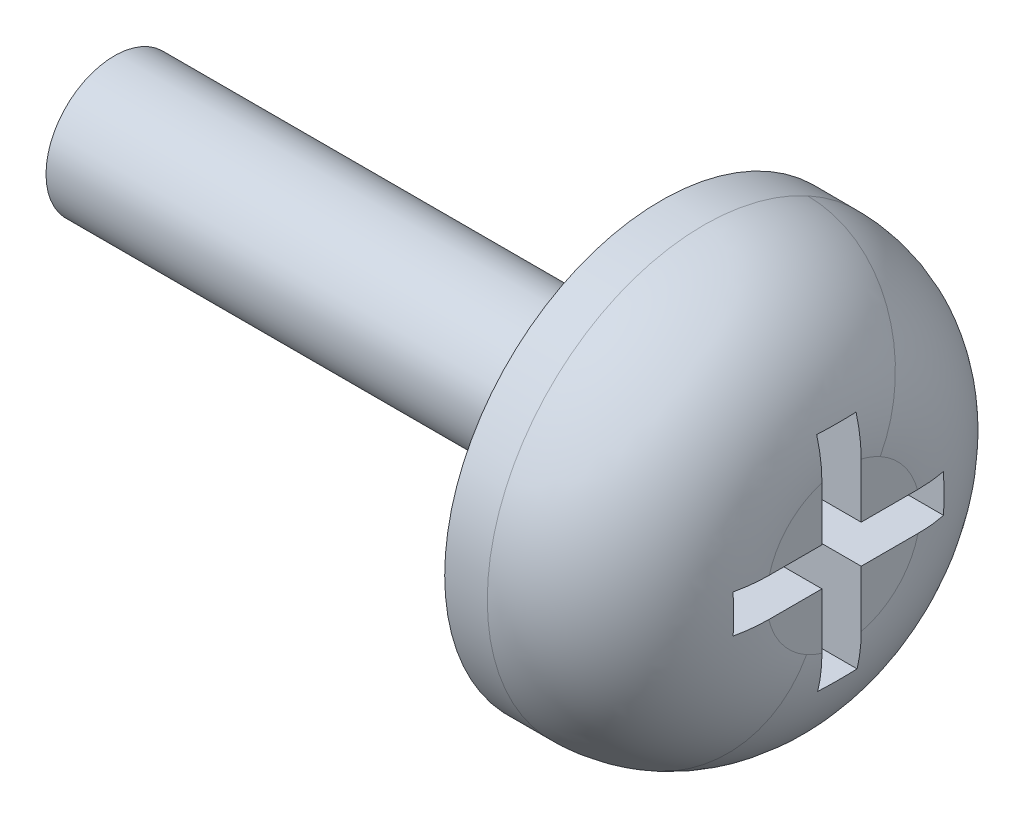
ISO-10303-21;
HEADER;
FILE_DESCRIPTION(('STEP AP214'),'2;1');
FILE_NAME('part.step','',(''),(''),'','','');
FILE_SCHEMA(('AUTOMOTIVE_DESIGN { 1 0 10303 214 1 1 1 1 }'));
ENDSEC;
DATA;
#1=APPLICATION_CONTEXT('core data for automotive mechanical design processes');
#2=APPLICATION_PROTOCOL_DEFINITION('international standard','automotive_design',2000,#1);
#3=PRODUCT_CONTEXT('',#1,'mechanical');
#4=PRODUCT('Part','Part','',(#3));
#5=PRODUCT_RELATED_PRODUCT_CATEGORY('part','',(#4));
#6=PRODUCT_DEFINITION_FORMATION('','',#4);
#7=PRODUCT_DEFINITION_CONTEXT('part definition',#1,'design');
#8=PRODUCT_DEFINITION('design','',#6,#7);
#9=PRODUCT_DEFINITION_SHAPE('','',#8);
#10=(LENGTH_UNIT() NAMED_UNIT(*) SI_UNIT(.MILLI.,.METRE.));
#11=(NAMED_UNIT(*) PLANE_ANGLE_UNIT() SI_UNIT($,.RADIAN.));
#12=(NAMED_UNIT(*) SI_UNIT($,.STERADIAN.) SOLID_ANGLE_UNIT());
#13=UNCERTAINTY_MEASURE_WITH_UNIT(LENGTH_MEASURE(1.E-05),#10,'distance_accuracy_value','');
#14=(GEOMETRIC_REPRESENTATION_CONTEXT(3) GLOBAL_UNCERTAINTY_ASSIGNED_CONTEXT((#13)) GLOBAL_UNIT_ASSIGNED_CONTEXT((#10,
#11,#12)) REPRESENTATION_CONTEXT('',''));
#15=CARTESIAN_POINT('',(0.,0.,0.));
#16=DIRECTION('',(0.,0.,1.));
#17=DIRECTION('',(1.,0.,0.));
#18=AXIS2_PLACEMENT_3D('',#15,#16,#17);
#19=CARTESIAN_POINT('',(0.,0.,2.340342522));
#20=DIRECTION('',(0.,0.,1.));
#21=DIRECTION('',(1.,0.,0.));
#22=AXIS2_PLACEMENT_3D('',#19,#20,#21);
#23=PLANE('',#22);
#24=DIRECTION('',(1.,0.,0.));
#25=VECTOR('',#24,1.);
#26=CARTESIAN_POINT('',(0.,-0.3962841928,2.340342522));
#27=LINE('',#26,#25);
#28=CARTESIAN_POINT('',(15.9216123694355,-0.396284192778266,2.340342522));
#29=VERTEX_POINT('',#28);
#30=CARTESIAN_POINT('',(14.,-0.3962841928,2.340342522));
#31=VERTEX_POINT('',#30);
#32=EDGE_CURVE('E161',#29,#31,#27,.F.);
#33=ORIENTED_EDGE('',*,*,#32,.T.);
#34=DIRECTION('',(0.,1.,0.));
#35=VECTOR('',#34,1.);
#36=CARTESIAN_POINT('',(14.,0.,2.340342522));
#37=LINE('',#36,#35);
#38=CARTESIAN_POINT('',(14.,0.4401714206,2.340342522));
#39=VERTEX_POINT('',#38);
#40=EDGE_CURVE('E170',#39,#31,#37,.F.);
#41=ORIENTED_EDGE('',*,*,#40,.F.);
#42=DIRECTION('',(-1.,0.,0.));
#43=VECTOR('',#42,1.);
#44=CARTESIAN_POINT('',(0.,0.4401714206,2.340342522));
#45=LINE('',#44,#43);
#46=CARTESIAN_POINT('',(15.9198215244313,0.44017142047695,2.34034252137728));
#47=VERTEX_POINT('',#46);
#48=EDGE_CURVE('E164',#39,#47,#45,.F.);
#49=ORIENTED_EDGE('',*,*,#48,.T.);
#50=CARTESIAN_POINT('',(15.921612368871,-0.396284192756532,2.340342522));
#51=CARTESIAN_POINT('',(15.9233983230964,-0.349822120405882,2.340342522));
#52=CARTESIAN_POINT('',(15.924852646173,-0.303347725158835,2.340342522));
#53=CARTESIAN_POINT('',(15.9271239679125,-0.210399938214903,2.340342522));
#54=CARTESIAN_POINT('',(15.9279411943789,-0.163926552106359,2.340342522));
#55=CARTESIAN_POINT('',(15.9289654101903,-0.0709814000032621,2.340342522));
#56=CARTESIAN_POINT('',(15.9291725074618,-0.0245096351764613,2.340342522));
#57=CARTESIAN_POINT('',(15.9289815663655,0.0684327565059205,2.340342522));
#58=CARTESIAN_POINT('',(15.9285835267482,0.114903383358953,2.340342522));
#59=CARTESIAN_POINT('',(15.9271719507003,0.207843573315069,2.340342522));
#60=CARTESIAN_POINT('',(15.926158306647,0.254313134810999,2.340342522));
#61=CARTESIAN_POINT('',(15.9234835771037,0.347250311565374,2.340342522));
#62=CARTESIAN_POINT('',(15.9218222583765,0.393717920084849,2.340342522));
#63=CARTESIAN_POINT('',(15.9198215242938,0.44017142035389,2.340342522));
#64=B_SPLINE_CURVE_WITH_KNOTS('',3,(#50,#51,#52,#53,#54,#55,#56,#57,#58,#59,#60,#61,#62,#63),
.UNSPECIFIED.,.F.,.F.,(4,2,2,2,2,2,4),(0.,0.139487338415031,0.278924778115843,0.418337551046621,
0.557750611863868,0.697188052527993,0.83667575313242),.UNSPECIFIED.);
#65=EDGE_CURVE('E36',#29,#47,#64,.T.);
#66=ORIENTED_EDGE('',*,*,#65,.F.);
#67=EDGE_LOOP('',(#33,#41,#49,#66));
#68=FACE_BOUND('',#67,.T.);
#69=ADVANCED_FACE('F32',(#68),#23,.F.);
#70=CARTESIAN_POINT('',(0.,-2.392984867,0.));
#71=DIRECTION('',(0.,-1.,0.));
#72=DIRECTION('',(1.,0.,0.));
#73=AXIS2_PLACEMENT_3D('',#70,#71,#72);
#74=PLANE('',#73);
#75=DIRECTION('',(-1.,0.,0.));
#76=VECTOR('',#75,1.);
#77=CARTESIAN_POINT('',(0.,-2.392984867,-0.3906822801));
#78=LINE('',#77,#76);
#79=CARTESIAN_POINT('',(15.9093883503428,-2.392984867,-0.390682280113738));
#80=VERTEX_POINT('',#79);
#81=CARTESIAN_POINT('',(14.,-2.392984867,-0.3906822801));
#82=VERTEX_POINT('',#81);
#83=EDGE_CURVE('E461',#80,#82,#78,.T.);
#84=ORIENTED_EDGE('',*,*,#83,.T.);
#85=DIRECTION('',(0.,0.,1.));
#86=VECTOR('',#85,1.);
#87=CARTESIAN_POINT('',(14.,-2.392984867,0.));
#88=LINE('',#87,#86);
#89=CARTESIAN_POINT('',(14.,-2.392984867,0.4703304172));
#90=VERTEX_POINT('',#89);
#91=EDGE_CURVE('E169',#90,#82,#88,.F.);
#92=ORIENTED_EDGE('',*,*,#91,.F.);
#93=DIRECTION('',(1.,0.,0.));
#94=VECTOR('',#93,1.);
#95=CARTESIAN_POINT('',(0.,-2.392984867,0.4703304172));
#96=LINE('',#95,#94);
#97=CARTESIAN_POINT('',(15.9058459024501,-2.39298486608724,0.470330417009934));
#98=VERTEX_POINT('',#97);
#99=EDGE_CURVE('E478',#90,#98,#96,.T.);
#100=ORIENTED_EDGE('',*,*,#99,.T.);
#101=CARTESIAN_POINT('',(15.9093883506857,-2.392984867,-0.390682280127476));
#102=CARTESIAN_POINT('',(15.911301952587,-2.392984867,-0.34285368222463));
#103=CARTESIAN_POINT('',(15.9128474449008,-2.392984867,-0.295010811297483));
#104=CARTESIAN_POINT('',(15.9152275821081,-2.392984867,-0.199327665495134));
#105=CARTESIAN_POINT('',(15.9160625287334,-2.392984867,-0.151487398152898));
#106=CARTESIAN_POINT('',(15.9170484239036,-2.392984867,-0.0558100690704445));
#107=CARTESIAN_POINT('',(15.917199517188,-2.392984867,-0.00797300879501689));
#108=CARTESIAN_POINT('',(15.9168209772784,-2.392984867,0.0876986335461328));
#109=CARTESIAN_POINT('',(15.9162913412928,-2.392984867,0.135533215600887));
#110=CARTESIAN_POINT('',(15.9145381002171,-2.392984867,0.231199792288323));
#111=CARTESIAN_POINT('',(15.9133143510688,-2.392984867,0.279031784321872));
#112=CARTESIAN_POINT('',(15.9101368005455,-2.392984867,0.374692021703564));
#113=CARTESIAN_POINT('',(15.9081826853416,-2.392984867,0.422520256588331));
#114=CARTESIAN_POINT('',(15.9058459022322,-2.392984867,0.470330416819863));
#115=B_SPLINE_CURVE_WITH_KNOTS('',3,(#101,#102,#103,#104,#105,#106,#107,#108,#109,#110,#111,
#112,#113,#114),.UNSPECIFIED.,.F.,.F.,(4,2,2,2,2,2,4),(0.,0.143598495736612,0.287135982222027,
0.430643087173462,0.574150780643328,0.717688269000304,0.861287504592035),.UNSPECIFIED.);
#116=EDGE_CURVE('E178',#80,#98,#115,.T.);
#117=ORIENTED_EDGE('',*,*,#116,.F.);
#118=EDGE_LOOP('',(#84,#92,#100,#117));
#119=FACE_BOUND('',#118,.T.);
#120=ADVANCED_FACE('F213',(#119),#74,.F.);
#121=CARTESIAN_POINT('',(0.,-0.3962841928,0.));
#122=DIRECTION('',(0.,-1.,0.));
#123=DIRECTION('',(1.,0.,0.));
#124=AXIS2_PLACEMENT_3D('',#121,#122,#123);
#125=PLANE('',#124);
#126=DIRECTION('',(0.,0.,1.));
#127=VECTOR('',#126,1.);
#128=CARTESIAN_POINT('',(16.,-0.3962841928,0.));
#129=LINE('',#128,#127);
#130=CARTESIAN_POINT('',(16.,-0.3962841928,0.4703304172));
#131=VERTEX_POINT('',#130);
#132=CARTESIAN_POINT('',(15.9999999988,-0.396284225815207,1.63763286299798));
#133=VERTEX_POINT('',#132);
#134=EDGE_CURVE('E177',#131,#133,#129,.T.);
#135=ORIENTED_EDGE('',*,*,#134,.F.);
#136=DIRECTION('',(1.,0.,0.));
#137=VECTOR('',#136,1.);
#138=CARTESIAN_POINT('',(0.,-0.3962841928,0.4703304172));
#139=LINE('',#138,#137);
#140=CARTESIAN_POINT('',(14.,-0.3962841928,0.4703304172));
#141=VERTEX_POINT('',#140);
#142=EDGE_CURVE('E481',#131,#141,#139,.F.);
#143=ORIENTED_EDGE('',*,*,#142,.T.);
#144=DIRECTION('',(0.,0.,1.));
#145=VECTOR('',#144,1.);
#146=CARTESIAN_POINT('',(14.,-0.3962841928,0.));
#147=LINE('',#146,#145);
#148=EDGE_CURVE('E176',#141,#31,#147,.T.);
#149=ORIENTED_EDGE('',*,*,#148,.T.);
#150=ORIENTED_EDGE('',*,*,#32,.F.);
#151=CARTESIAN_POINT('',(15.999999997,-0.3962841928,1.63763286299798));
#152=CARTESIAN_POINT('',(16.0000009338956,-0.3962841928,1.6770867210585));
#153=CARTESIAN_POINT('',(15.9992803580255,-0.3962841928,1.71654107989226));
#154=CARTESIAN_POINT('',(15.9963900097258,-0.3962841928,1.79528766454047));
#155=CARTESIAN_POINT('',(15.9942242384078,-0.3962841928,1.83458003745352));
#156=CARTESIAN_POINT('',(15.9884414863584,-0.3962841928,1.91300271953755));
#157=CARTESIAN_POINT('',(15.9848265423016,-0.3962841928,1.952133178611));
#158=CARTESIAN_POINT('',(15.9761411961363,-0.3962841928,2.03023320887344));
#159=CARTESIAN_POINT('',(15.9710707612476,-0.3962841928,2.0692027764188));
#160=CARTESIAN_POINT('',(15.9594656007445,-0.3962841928,2.14697836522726));
#161=CARTESIAN_POINT('',(15.9529288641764,-0.396284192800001,2.18578408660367));
#162=CARTESIAN_POINT('',(15.9383784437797,-0.396284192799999,2.26322982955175));
#163=CARTESIAN_POINT('',(15.930360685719,-0.396284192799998,2.30186908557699));
#164=CARTESIAN_POINT('',(15.9216123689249,-0.396284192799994,2.34034252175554));
#165=B_SPLINE_CURVE_WITH_KNOTS('',3,(#151,#152,#153,#154,#155,#156,#157,#158,#159,#160,#161,
#162,#163,#164),.UNSPECIFIED.,.F.,.F.,(4,2,2,2,2,2,4),(0.,0.118355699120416,0.236385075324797,
0.354249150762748,0.472115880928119,0.590145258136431,0.708504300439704),.UNSPECIFIED.);
#166=EDGE_CURVE('E173',#133,#29,#165,.T.);
#167=ORIENTED_EDGE('',*,*,#166,.F.);
#168=EDGE_LOOP('',(#135,#143,#149,#150,#167));
#169=FACE_BOUND('',#168,.T.);
#170=ADVANCED_FACE('F172',(#169),#125,.F.);
#171=CARTESIAN_POINT('',(0.,0.4401714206,0.));
#172=DIRECTION('',(0.,1.,0.));
#173=DIRECTION('',(-1.,0.,0.));
#174=AXIS2_PLACEMENT_3D('',#171,#172,#173);
#175=PLANE('',#174);
#176=ORIENTED_EDGE('',*,*,#48,.F.);
#177=DIRECTION('',(0.,0.,1.));
#178=VECTOR('',#177,1.);
#179=CARTESIAN_POINT('',(14.,0.4401714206,0.));
#180=LINE('',#179,#178);
#181=CARTESIAN_POINT('',(14.,0.4401714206,0.4703304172));
#182=VERTEX_POINT('',#181);
#183=EDGE_CURVE('E492',#39,#182,#180,.F.);
#184=ORIENTED_EDGE('',*,*,#183,.T.);
#185=DIRECTION('',(1.,0.,0.));
#186=VECTOR('',#185,1.);
#187=CARTESIAN_POINT('',(0.,0.4401714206,0.4703304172));
#188=LINE('',#187,#186);
#189=CARTESIAN_POINT('',(16.,0.4401714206,0.4703304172));
#190=VERTEX_POINT('',#189);
#191=EDGE_CURVE('E497',#182,#190,#188,.T.);
#192=ORIENTED_EDGE('',*,*,#191,.T.);
#193=DIRECTION('',(0.,0.,1.));
#194=VECTOR('',#193,1.);
#195=CARTESIAN_POINT('',(16.,0.4401714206,0.));
#196=LINE('',#195,#194);
#197=CARTESIAN_POINT('',(15.9999999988,0.440171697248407,1.62638597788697));
#198=VERTEX_POINT('',#197);
#199=EDGE_CURVE('E186',#198,#190,#196,.F.);
#200=ORIENTED_EDGE('',*,*,#199,.F.);
#201=CARTESIAN_POINT('',(15.9198215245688,0.440171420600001,2.34034252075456));
#202=CARTESIAN_POINT('',(15.9287834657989,0.4401714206,2.30126342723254));
#203=CARTESIAN_POINT('',(15.9369942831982,0.4401714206,2.26201245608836));
#204=CARTESIAN_POINT('',(15.9518900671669,0.4401714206,2.18333730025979));
#205=CARTESIAN_POINT('',(15.958579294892,0.4401714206,2.14391392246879));
#206=CARTESIAN_POINT('',(15.9704508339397,0.4401714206,2.06489747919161));
#207=CARTESIAN_POINT('',(15.9756352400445,0.4401714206,2.02530472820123));
#208=CARTESIAN_POINT('',(15.9845122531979,0.4401714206,1.94595359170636));
#209=CARTESIAN_POINT('',(15.9882049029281,0.4401714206,1.90619521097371));
#210=CARTESIAN_POINT('',(15.9941094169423,0.4401714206,1.82651175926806));
#211=CARTESIAN_POINT('',(15.9963191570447,0.440171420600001,1.78658653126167));
#212=CARTESIAN_POINT('',(15.999267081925,0.440171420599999,1.70656941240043));
#213=CARTESIAN_POINT('',(16.0000011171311,0.440171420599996,1.6664773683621));
#214=CARTESIAN_POINT('',(15.999999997,0.440171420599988,1.62638597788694));
#215=B_SPLINE_CURVE_WITH_KNOTS('',3,(#201,#202,#203,#204,#205,#206,#207,#208,#209,#210,#211,
#212,#213,#214),.UNSPECIFIED.,.F.,.F.,(4,2,2,2,2,2,4),(0.,0.120272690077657,0.240204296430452,
0.359968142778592,0.47972856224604,0.599660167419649,0.719928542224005),.UNSPECIFIED.);
#216=EDGE_CURVE('E502',#47,#198,#215,.T.);
#217=ORIENTED_EDGE('',*,*,#216,.F.);
#218=EDGE_LOOP('',(#176,#184,#192,#200,#217));
#219=FACE_BOUND('',#218,.T.);
#220=ADVANCED_FACE('F212',(#219),#175,.F.);
#221=CARTESIAN_POINT('',(0.,0.,0.4703304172));
#222=DIRECTION('',(0.,0.,1.));
#223=DIRECTION('',(1.,0.,0.));
#224=AXIS2_PLACEMENT_3D('',#221,#222,#223);
#225=PLANE('',#224);
#226=DIRECTION('',(0.,1.,0.));
#227=VECTOR('',#226,1.);
#228=CARTESIAN_POINT('',(16.,0.,0.4703304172));
#229=LINE('',#228,#227);
#230=CARTESIAN_POINT('',(15.9999999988,1.61792209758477,0.470330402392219));
#231=VERTEX_POINT('',#230);
#232=EDGE_CURVE('E495',#190,#231,#229,.T.);
#233=ORIENTED_EDGE('',*,*,#232,.F.);
#234=ORIENTED_EDGE('',*,*,#191,.F.);
#235=DIRECTION('',(0.,1.,0.));
#236=VECTOR('',#235,1.);
#237=CARTESIAN_POINT('',(14.,0.,0.4703304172));
#238=LINE('',#237,#236);
#239=CARTESIAN_POINT('',(14.,2.477345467,0.4703304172));
#240=VERTEX_POINT('',#239);
#241=EDGE_CURVE('E475',#182,#240,#238,.T.);
#242=ORIENTED_EDGE('',*,*,#241,.T.);
#243=DIRECTION('',(-1.,0.,0.));
#244=VECTOR('',#243,1.);
#245=CARTESIAN_POINT('',(0.,2.477345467,0.4703304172));
#246=LINE('',#245,#244);
#247=CARTESIAN_POINT('',(15.883590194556,2.4773454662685,0.47033041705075));
#248=VERTEX_POINT('',#247);
#249=EDGE_CURVE('E468',#240,#248,#246,.F.);
#250=ORIENTED_EDGE('',*,*,#249,.T.);
#251=CARTESIAN_POINT('',(15.999999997,1.61792209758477,0.4703304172));
#252=CARTESIAN_POINT('',(16.000000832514,1.65431502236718,0.4703304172));
#253=CARTESIAN_POINT('',(15.999402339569,1.69070846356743,0.4703304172));
#254=CARTESIAN_POINT('',(15.9969982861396,1.76333096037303,0.4703304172));
#255=CARTESIAN_POINT('',(15.9951968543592,1.7995601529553,0.4703304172));
#256=CARTESIAN_POINT('',(15.9903842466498,1.87185413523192,0.4703304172));
#257=CARTESIAN_POINT('',(15.9873758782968,1.90791911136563,0.4703304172));
#258=CARTESIAN_POINT('',(15.9801465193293,1.97988429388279,0.4703304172));
#259=CARTESIAN_POINT('',(15.9759269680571,2.01578464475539,0.4703304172));
#260=CARTESIAN_POINT('',(15.966269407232,2.08742339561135,0.4703304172));
#261=CARTESIAN_POINT('',(15.9608313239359,2.12316178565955,0.4703304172));
#262=CARTESIAN_POINT('',(15.948728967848,2.19447221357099,0.4703304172));
#263=CARTESIAN_POINT('',(15.9420633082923,2.23004401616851,0.4703304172));
#264=CARTESIAN_POINT('',(15.9274946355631,2.30101904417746,0.4703304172));
#265=CARTESIAN_POINT('',(15.9195888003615,2.33642169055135,0.4703304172));
#266=CARTESIAN_POINT('',(15.9025257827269,2.40705559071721,0.4703304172));
#267=CARTESIAN_POINT('',(15.8933643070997,2.44228580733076,0.4703304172));
#268=CARTESIAN_POINT('',(15.883590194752,2.47734546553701,0.4703304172));
#269=B_SPLINE_CURVE_WITH_KNOTS('',3,(#251,#252,#253,#254,#255,#256,#257,#258,#259,#260,#261,
#262,#263,#264,#265,#266,#267,#268),.UNSPECIFIED.,.F.,.F.,(4,2,2,2,2,2,2,2,4),(0.,
0.109174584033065,0.217976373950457,0.326526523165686,0.434948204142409,0.543376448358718,
0.651927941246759,0.76073012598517,0.869914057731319),.UNSPECIFIED.);
#270=EDGE_CURVE('E487',#231,#248,#269,.T.);
#271=ORIENTED_EDGE('',*,*,#270,.F.);
#272=EDGE_LOOP('',(#233,#234,#242,#250,#271));
#273=FACE_BOUND('',#272,.T.);
#274=ADVANCED_FACE('F594',(#273),#225,.F.);
#275=CARTESIAN_POINT('',(0.,0.,0.4703304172));
#276=DIRECTION('',(0.,0.,1.));
#277=DIRECTION('',(1.,0.,0.));
#278=AXIS2_PLACEMENT_3D('',#275,#276,#277);
#279=PLANE('',#278);
#280=ORIENTED_EDGE('',*,*,#99,.F.);
#281=DIRECTION('',(0.,1.,0.));
#282=VECTOR('',#281,1.);
#283=CARTESIAN_POINT('',(14.,0.,0.4703304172));
#284=LINE('',#283,#282);
#285=EDGE_CURVE('E437',#90,#141,#284,.T.);
#286=ORIENTED_EDGE('',*,*,#285,.T.);
#287=ORIENTED_EDGE('',*,*,#142,.F.);
#288=DIRECTION('',(0.,1.,0.));
#289=VECTOR('',#288,1.);
#290=CARTESIAN_POINT('',(16.,0.,0.4703304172));
#291=LINE('',#290,#289);
#292=CARTESIAN_POINT('',(15.9999999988,-1.61792206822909,0.470330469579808));
#293=VERTEX_POINT('',#292);
#294=EDGE_CURVE('E484',#293,#131,#291,.T.);
#295=ORIENTED_EDGE('',*,*,#294,.F.);
#296=CARTESIAN_POINT('',(15.9058459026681,-2.39298486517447,0.4703304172));
#297=CARTESIAN_POINT('',(15.9163821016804,-2.35067174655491,0.4703304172));
#298=CARTESIAN_POINT('',(15.9260343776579,-2.30813908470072,0.4703304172));
#299=CARTESIAN_POINT('',(15.9435382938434,-2.22285223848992,0.4703304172));
#300=CARTESIAN_POINT('',(15.9513958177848,-2.18009926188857,0.4703304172));
#301=CARTESIAN_POINT('',(15.9653361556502,-2.09437701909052,0.4703304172));
#302=CARTESIAN_POINT('',(15.9714218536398,-2.051408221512,0.4703304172));
#303=CARTESIAN_POINT('',(15.9818392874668,-1.96526041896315,0.4703304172));
#304=CARTESIAN_POINT('',(15.9861710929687,-1.92208142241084,0.470330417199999));
#305=CARTESIAN_POINT('',(15.9930961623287,-1.83551165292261,0.470330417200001));
#306=CARTESIAN_POINT('',(15.9956864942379,-1.79212064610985,0.470330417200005));
#307=CARTESIAN_POINT('',(15.9991420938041,-1.70512692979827,0.470330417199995));
#308=CARTESIAN_POINT('',(16.0000016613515,-1.66152399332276,0.470330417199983));
#309=CARTESIAN_POINT('',(15.999999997,-1.61792206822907,0.470330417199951));
#310=B_SPLINE_CURVE_WITH_KNOTS('',3,(#296,#297,#298,#299,#300,#301,#302,#303,#304,#305,#306,
#307,#308,#309),.UNSPECIFIED.,.F.,.F.,(4,2,2,2,2,2,4),(0.,0.130805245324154,0.261175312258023,
0.391331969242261,0.521483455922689,0.651853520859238,0.782652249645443),.UNSPECIFIED.);
#311=EDGE_CURVE('E471',#98,#293,#310,.T.);
#312=ORIENTED_EDGE('',*,*,#311,.F.);
#313=EDGE_LOOP('',(#280,#286,#287,#295,#312));
#314=FACE_BOUND('',#313,.T.);
#315=ADVANCED_FACE('F590',(#314),#279,.F.);
#316=CARTESIAN_POINT('',(0.,2.477345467,0.));
#317=DIRECTION('',(0.,1.,0.));
#318=DIRECTION('',(-1.,0.,0.));
#319=AXIS2_PLACEMENT_3D('',#316,#317,#318);
#320=PLANE('',#319);
#321=ORIENTED_EDGE('',*,*,#249,.F.);
#322=DIRECTION('',(0.,0.,1.));
#323=VECTOR('',#322,1.);
#324=CARTESIAN_POINT('',(14.,2.477345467,0.));
#325=LINE('',#324,#323);
#326=CARTESIAN_POINT('',(14.,2.477345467,-0.3906822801));
#327=VERTEX_POINT('',#326);
#328=EDGE_CURVE('E447',#240,#327,#325,.F.);
#329=ORIENTED_EDGE('',*,*,#328,.T.);
#330=DIRECTION('',(-1.,0.,0.));
#331=VECTOR('',#330,1.);
#332=CARTESIAN_POINT('',(0.,2.477345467,-0.3906822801));
#333=LINE('',#332,#331);
#334=CARTESIAN_POINT('',(15.8874251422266,2.47734546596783,-0.390682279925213));
#335=VERTEX_POINT('',#334);
#336=EDGE_CURVE('E429',#327,#335,#333,.F.);
#337=ORIENTED_EDGE('',*,*,#336,.T.);
#338=CARTESIAN_POINT('',(15.88359019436,2.477345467,0.470330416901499));
#339=CARTESIAN_POINT('',(15.8861176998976,2.477345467,0.422524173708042));
#340=CARTESIAN_POINT('',(15.888235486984,2.477345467,0.374696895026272));
#341=CARTESIAN_POINT('',(15.8916832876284,2.477345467,0.27903805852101));
#342=CARTESIAN_POINT('',(15.8930136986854,2.477345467,0.231206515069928));
#343=CARTESIAN_POINT('',(15.8949206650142,2.477345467,0.135540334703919));
#344=CARTESIAN_POINT('',(15.8954974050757,2.477345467,0.0877057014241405));
#345=CARTESIAN_POINT('',(15.8959096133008,2.477345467,-0.00796654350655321));
#346=CARTESIAN_POINT('',(15.895745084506,2.477345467,-0.055804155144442));
#347=CARTESIAN_POINT('',(15.8946719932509,2.477345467,-0.15148309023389));
#348=CARTESIAN_POINT('',(15.8937632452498,2.477345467,-0.199324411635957));
#349=CARTESIAN_POINT('',(15.8911770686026,2.477345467,-0.29501016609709));
#350=CARTESIAN_POINT('',(15.8894992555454,2.477345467,-0.342854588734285));
#351=CARTESIAN_POINT('',(15.88742514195,2.477345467,-0.390682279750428));
#352=B_SPLINE_CURVE_WITH_KNOTS('',3,(#338,#339,#340,#341,#342,#343,#344,#345,#346,#347,#348,
#349,#350,#351),.UNSPECIFIED.,.F.,.F.,(4,2,2,2,2,2,4),(0.,0.143616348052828,0.287160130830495,
0.430668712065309,0.574176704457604,0.717720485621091,0.861336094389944),.UNSPECIFIED.);
#353=EDGE_CURVE('E465',#248,#335,#352,.T.);
#354=ORIENTED_EDGE('',*,*,#353,.F.);
#355=EDGE_LOOP('',(#321,#329,#337,#354));
#356=FACE_BOUND('',#355,.T.);
#357=ADVANCED_FACE('F585',(#356),#320,.F.);
#358=CARTESIAN_POINT('',(0.,0.,-0.3906822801));
#359=DIRECTION('',(0.,0.,-1.));
#360=DIRECTION('',(-1.,0.,0.));
#361=AXIS2_PLACEMENT_3D('',#358,#359,#360);
#362=PLANE('',#361);
#363=DIRECTION('',(0.,1.,0.));
#364=VECTOR('',#363,1.);
#365=CARTESIAN_POINT('',(16.,0.,-0.3906822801));
#366=LINE('',#365,#364);
#367=CARTESIAN_POINT('',(16.,-0.3962841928,-0.3906822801));
#368=VERTEX_POINT('',#367);
#369=CARTESIAN_POINT('',(15.9999999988,-1.63897833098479,-0.390682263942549));
#370=VERTEX_POINT('',#369);
#371=EDGE_CURVE('E458',#368,#370,#366,.F.);
#372=ORIENTED_EDGE('',*,*,#371,.F.);
#373=DIRECTION('',(1.,0.,0.));
#374=VECTOR('',#373,1.);
#375=CARTESIAN_POINT('',(0.,-0.3962841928,-0.3906822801));
#376=LINE('',#375,#374);
#377=CARTESIAN_POINT('',(14.,-0.3962841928,-0.3906822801));
#378=VERTEX_POINT('',#377);
#379=EDGE_CURVE('E405',#368,#378,#376,.F.);
#380=ORIENTED_EDGE('',*,*,#379,.T.);
#381=DIRECTION('',(0.,1.,0.));
#382=VECTOR('',#381,1.);
#383=CARTESIAN_POINT('',(14.,0.,-0.3906822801));
#384=LINE('',#383,#382);
#385=EDGE_CURVE('E446',#378,#82,#384,.F.);
#386=ORIENTED_EDGE('',*,*,#385,.T.);
#387=ORIENTED_EDGE('',*,*,#83,.F.);
#388=CARTESIAN_POINT('',(15.999999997,-1.63897833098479,-0.390682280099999));
#389=CARTESIAN_POINT('',(16.0000012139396,-1.6813835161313,-0.3906822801));
#390=CARTESIAN_POINT('',(15.9991672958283,-1.7237893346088,-0.3906822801));
#391=CARTESIAN_POINT('',(15.9958229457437,-1.80839903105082,-0.3906822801));
#392=CARTESIAN_POINT('',(15.9933178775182,-1.85060312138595,-0.3906822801));
#393=CARTESIAN_POINT('',(15.9866305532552,-1.9348095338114,-0.3906822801));
#394=CARTESIAN_POINT('',(15.9824510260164,-1.97681207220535,-0.3906822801));
#395=CARTESIAN_POINT('',(15.9724108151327,-2.06061694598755,-0.3906822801));
#396=CARTESIAN_POINT('',(15.9665500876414,-2.10241927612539,-0.3906822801));
#397=CARTESIAN_POINT('',(15.9531371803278,-2.18582044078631,-0.3906822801));
#398=CARTESIAN_POINT('',(15.9455823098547,-2.22741884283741,-0.390682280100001));
#399=CARTESIAN_POINT('',(15.9287654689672,-2.31040931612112,-0.390682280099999));
#400=CARTESIAN_POINT('',(15.9194980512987,-2.35180028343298,-0.390682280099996));
#401=CARTESIAN_POINT('',(15.9093883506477,-2.39298486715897,-0.390682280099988));
#402=B_SPLINE_CURVE_WITH_KNOTS('',3,(#388,#389,#390,#391,#392,#393,#394,#395,#396,#397,#398,
#399,#400,#401),.UNSPECIFIED.,.F.,.F.,(4,2,2,2,2,2,4),(0.,0.12720824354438,0.25401014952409,
0.380606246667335,0.507205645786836,0.634007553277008,0.76121995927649),.UNSPECIFIED.);
#403=EDGE_CURVE('E460',#370,#80,#402,.T.);
#404=ORIENTED_EDGE('',*,*,#403,.F.);
#405=EDGE_LOOP('',(#372,#380,#386,#387,#404));
#406=FACE_BOUND('',#405,.T.);
#407=ADVANCED_FACE('F582',(#406),#362,.F.);
#408=CARTESIAN_POINT('',(14.,0.,0.));
#409=DIRECTION('',(-1.,0.,0.));
#410=DIRECTION('',(0.,0.,1.));
#411=AXIS2_PLACEMENT_3D('',#408,#409,#410);
#412=PLANE('',#411);
#413=ORIENTED_EDGE('',*,*,#91,.T.);
#414=ORIENTED_EDGE('',*,*,#385,.F.);
#415=DIRECTION('',(0.,0.,1.));
#416=VECTOR('',#415,1.);
#417=CARTESIAN_POINT('',(14.,-0.3962841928,0.));
#418=LINE('',#417,#416);
#419=CARTESIAN_POINT('',(14.,-0.3962841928,-2.260694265));
#420=VERTEX_POINT('',#419);
#421=EDGE_CURVE('E409',#378,#420,#418,.F.);
#422=ORIENTED_EDGE('',*,*,#421,.T.);
#423=DIRECTION('',(0.,1.,0.));
#424=VECTOR('',#423,1.);
#425=CARTESIAN_POINT('',(14.,0.,-2.260694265));
#426=LINE('',#425,#424);
#427=CARTESIAN_POINT('',(14.,0.4401714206,-2.260694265));
#428=VERTEX_POINT('',#427);
#429=EDGE_CURVE('E444',#428,#420,#426,.F.);
#430=ORIENTED_EDGE('',*,*,#429,.F.);
#431=DIRECTION('',(0.,0.,1.));
#432=VECTOR('',#431,1.);
#433=CARTESIAN_POINT('',(14.,0.4401714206,0.));
#434=LINE('',#433,#432);
#435=CARTESIAN_POINT('',(14.,0.4401714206,-0.3906822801));
#436=VERTEX_POINT('',#435);
#437=EDGE_CURVE('E397',#428,#436,#434,.T.);
#438=ORIENTED_EDGE('',*,*,#437,.T.);
#439=DIRECTION('',(0.,1.,0.));
#440=VECTOR('',#439,1.);
#441=CARTESIAN_POINT('',(14.,0.,-0.3906822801));
#442=LINE('',#441,#440);
#443=EDGE_CURVE('E432',#436,#327,#442,.T.);
#444=ORIENTED_EDGE('',*,*,#443,.T.);
#445=ORIENTED_EDGE('',*,*,#328,.F.);
#446=ORIENTED_EDGE('',*,*,#241,.F.);
#447=ORIENTED_EDGE('',*,*,#183,.F.);
#448=ORIENTED_EDGE('',*,*,#40,.T.);
#449=ORIENTED_EDGE('',*,*,#148,.F.);
#450=ORIENTED_EDGE('',*,*,#285,.F.);
#451=EDGE_LOOP('',(#413,#414,#422,#430,#438,#444,#445,#446,#447,#448,#449,#450));
#452=FACE_BOUND('',#451,.T.);
#453=ADVANCED_FACE('F562',(#452),#412,.F.);
#454=CARTESIAN_POINT('',(0.,0.,-0.3906822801));
#455=DIRECTION('',(0.,0.,-1.));
#456=DIRECTION('',(-1.,0.,0.));
#457=AXIS2_PLACEMENT_3D('',#454,#455,#456);
#458=PLANE('',#457);
#459=ORIENTED_EDGE('',*,*,#336,.F.);
#460=ORIENTED_EDGE('',*,*,#443,.F.);
#461=DIRECTION('',(-1.,0.,0.));
#462=VECTOR('',#461,1.);
#463=CARTESIAN_POINT('',(0.,0.4401714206,-0.3906822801));
#464=LINE('',#463,#462);
#465=CARTESIAN_POINT('',(16.,0.4401714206,-0.3906822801));
#466=VERTEX_POINT('',#465);
#467=EDGE_CURVE('E394',#436,#466,#464,.F.);
#468=ORIENTED_EDGE('',*,*,#467,.T.);
#469=DIRECTION('',(0.,1.,0.));
#470=VECTOR('',#469,1.);
#471=CARTESIAN_POINT('',(16.,0.,-0.3906822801));
#472=LINE('',#471,#470);
#473=CARTESIAN_POINT('',(15.9999999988,1.6389783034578,-0.390682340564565));
#474=VERTEX_POINT('',#473);
#475=EDGE_CURVE('E435',#474,#466,#472,.F.);
#476=ORIENTED_EDGE('',*,*,#475,.F.);
#477=CARTESIAN_POINT('',(15.8874251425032,2.47734546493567,-0.3906822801));
#478=CARTESIAN_POINT('',(15.8968481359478,2.44312646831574,-0.3906822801));
#479=CARTESIAN_POINT('',(15.9056845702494,2.40874610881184,-0.3906822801));
#480=CARTESIAN_POINT('',(15.9221504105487,2.33982112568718,-0.3906822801));
#481=CARTESIAN_POINT('',(15.9297838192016,2.30527745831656,-0.3906822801));
#482=CARTESIAN_POINT('',(15.943858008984,2.23602898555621,-0.3906822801));
#483=CARTESIAN_POINT('',(15.9503014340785,2.20132471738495,-0.3906822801));
#484=CARTESIAN_POINT('',(15.9620070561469,2.13175739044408,-0.3906822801));
#485=CARTESIAN_POINT('',(15.9672705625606,2.09689455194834,-0.3906822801));
#486=CARTESIAN_POINT('',(15.9766241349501,2.02701329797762,-0.3906822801));
#487=CARTESIAN_POINT('',(15.9807142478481,1.99199488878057,-0.390682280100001));
#488=CARTESIAN_POINT('',(15.9877266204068,1.92180077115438,-0.3906822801));
#489=CARTESIAN_POINT('',(15.9906475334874,1.88662492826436,-0.390682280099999));
#490=CARTESIAN_POINT('',(15.9953237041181,1.81611612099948,-0.390682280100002));
#491=CARTESIAN_POINT('',(15.9970763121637,1.78078298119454,-0.390682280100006));
#492=CARTESIAN_POINT('',(15.9994167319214,1.7099593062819,-0.390682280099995));
#493=CARTESIAN_POINT('',(16.0000006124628,1.67446864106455,-0.390682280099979));
#494=CARTESIAN_POINT('',(15.999999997,1.63897830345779,-0.390682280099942));
#495=B_SPLINE_CURVE_WITH_KNOTS('',3,(#477,#478,#479,#480,#481,#482,#483,#484,#485,#486,#487,
#488,#489,#490,#491,#492,#493,#494),.UNSPECIFIED.,.F.,.F.,(4,2,2,2,2,2,2,2,4),(0.,
0.106472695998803,0.212583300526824,0.318455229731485,0.424209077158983,0.529958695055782,
0.635829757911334,0.741940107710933,0.848406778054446),.UNSPECIFIED.);
#496=EDGE_CURVE('E406',#335,#474,#495,.T.);
#497=ORIENTED_EDGE('',*,*,#496,.F.);
#498=EDGE_LOOP('',(#459,#460,#468,#476,#497));
#499=FACE_BOUND('',#498,.T.);
#500=ADVANCED_FACE('F557',(#499),#458,.F.);
#501=CARTESIAN_POINT('',(0.,-0.3962841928,0.));
#502=DIRECTION('',(0.,-1.,0.));
#503=DIRECTION('',(1.,0.,0.));
#504=AXIS2_PLACEMENT_3D('',#501,#502,#503);
#505=PLANE('',#504);
#506=DIRECTION('',(-1.,0.,0.));
#507=VECTOR('',#506,1.);
#508=CARTESIAN_POINT('',(0.,-0.3962841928,-2.260694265));
#509=LINE('',#508,#507);
#510=CARTESIAN_POINT('',(15.9386332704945,-0.3962841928,-2.26069426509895));
#511=VERTEX_POINT('',#510);
#512=EDGE_CURVE('E333',#511,#420,#509,.T.);
#513=ORIENTED_EDGE('',*,*,#512,.T.);
#514=ORIENTED_EDGE('',*,*,#421,.F.);
#515=ORIENTED_EDGE('',*,*,#379,.F.);
#516=DIRECTION('',(0.,0.,1.));
#517=VECTOR('',#516,1.);
#518=CARTESIAN_POINT('',(16.,-0.3962841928,0.));
#519=LINE('',#518,#517);
#520=CARTESIAN_POINT('',(15.9999999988,-0.396284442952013,-1.63763278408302));
#521=VERTEX_POINT('',#520);
#522=EDGE_CURVE('E403',#521,#368,#519,.T.);
#523=ORIENTED_EDGE('',*,*,#522,.F.);
#524=CARTESIAN_POINT('',(15.9386332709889,-0.396284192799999,-2.2606942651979));
#525=CARTESIAN_POINT('',(15.9454823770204,-0.3962841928,-2.22647074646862));
#526=CARTESIAN_POINT('',(15.9517581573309,-0.3962841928,-2.19213268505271));
#527=CARTESIAN_POINT('',(15.9631494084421,-0.3962841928,-2.12334132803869));
#528=CARTESIAN_POINT('',(15.9682673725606,-0.3962841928,-2.08888844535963));
#529=CARTESIAN_POINT('',(15.9773542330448,-0.3962841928,-2.01986927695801));
#530=CARTESIAN_POINT('',(15.9813243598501,-0.3962841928,-1.98530315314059));
#531=CARTESIAN_POINT('',(15.9881244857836,-0.3962841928,-1.91605957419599));
#532=CARTESIAN_POINT('',(15.99095450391,-0.3962841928,-1.88138212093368));
#533=CARTESIAN_POINT('',(15.9954807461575,-0.3962841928,-1.81191533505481));
#534=CARTESIAN_POINT('',(15.9971757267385,-0.3962841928,-1.77712592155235));
#535=CARTESIAN_POINT('',(15.9994368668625,-0.3962841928,-1.70743521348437));
#536=CARTESIAN_POINT('',(16.0000005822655,-0.3962841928,-1.672533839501));
#537=CARTESIAN_POINT('',(15.999999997,-0.396284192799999,-1.637632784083));
#538=B_SPLINE_CURVE_WITH_KNOTS('',3,(#524,#525,#526,#527,#528,#529,#530,#531,#532,#533,#534,
#535,#536,#537),.UNSPECIFIED.,.F.,.F.,(4,2,2,2,2,2,4),(0.,0.104701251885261,0.209174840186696,
0.313536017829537,0.417895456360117,0.522369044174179,0.627068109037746),.UNSPECIFIED.);
#539=EDGE_CURVE('E400',#511,#521,#538,.T.);
#540=ORIENTED_EDGE('',*,*,#539,.F.);
#541=EDGE_LOOP('',(#513,#514,#515,#523,#540));
#542=FACE_BOUND('',#541,.T.);
#543=ADVANCED_FACE('F553',(#542),#505,.F.);
#544=CARTESIAN_POINT('',(0.,0.4401714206,0.));
#545=DIRECTION('',(0.,1.,0.));
#546=DIRECTION('',(-1.,0.,0.));
#547=AXIS2_PLACEMENT_3D('',#544,#545,#546);
#548=PLANE('',#547);
#549=DIRECTION('',(0.,0.,1.));
#550=VECTOR('',#549,1.);
#551=CARTESIAN_POINT('',(16.,0.4401714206,0.));
#552=LINE('',#551,#550);
#553=CARTESIAN_POINT('',(15.9999999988,0.440171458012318,-1.62638607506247));
#554=VERTEX_POINT('',#553);
#555=EDGE_CURVE('E386',#466,#554,#552,.F.);
#556=ORIENTED_EDGE('',*,*,#555,.F.);
#557=ORIENTED_EDGE('',*,*,#467,.F.);
#558=ORIENTED_EDGE('',*,*,#437,.F.);
#559=DIRECTION('',(-1.,0.,0.));
#560=VECTOR('',#559,1.);
#561=CARTESIAN_POINT('',(0.,0.4401714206,-2.260694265));
#562=LINE('',#561,#560);
#563=CARTESIAN_POINT('',(15.9370002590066,0.4401714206,-2.26069426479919));
#564=VERTEX_POINT('',#563);
#565=EDGE_CURVE('E325',#428,#564,#562,.F.);
#566=ORIENTED_EDGE('',*,*,#565,.T.);
#567=CARTESIAN_POINT('',(15.999999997,0.4401714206,-1.62638607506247));
#568=CARTESIAN_POINT('',(16.0000007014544,0.4401714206,-1.66192229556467));
#569=CARTESIAN_POINT('',(15.9994241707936,0.4401714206,-1.69745893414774));
#570=CARTESIAN_POINT('',(15.9971090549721,0.4401714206,-1.76841621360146));
#571=CARTESIAN_POINT('',(15.9953730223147,0.4401714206,-1.80383693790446));
#572=CARTESIAN_POINT('',(15.9907339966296,0.4401714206,-1.87456231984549));
#573=CARTESIAN_POINT('',(15.9878323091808,0.4401714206,-1.90986706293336));
#574=CARTESIAN_POINT('',(15.9808563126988,0.4401714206,-1.98036133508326));
#575=CARTESIAN_POINT('',(15.9767819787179,0.4401714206,-2.01555086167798));
#576=CARTESIAN_POINT('',(15.9674524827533,0.4401714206,-2.08581242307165));
#577=CARTESIAN_POINT('',(15.9621960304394,0.4401714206,-2.12088428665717));
#578=CARTESIAN_POINT('',(15.9504920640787,0.4401714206,-2.19090892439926));
#579=CARTESIAN_POINT('',(15.9440419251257,0.4401714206,-2.22586125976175));
#580=CARTESIAN_POINT('',(15.9370002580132,0.440171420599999,-2.26069426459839));
#581=B_SPLINE_CURVE_WITH_KNOTS('',3,(#567,#568,#569,#570,#571,#572,#573,#574,#575,#576,#577,
#578,#579,#580),.UNSPECIFIED.,.F.,.F.,(4,2,2,2,2,2,4),(0.,0.10660457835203,0.212975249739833,
0.319227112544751,0.425481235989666,0.531851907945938,0.638459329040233),.UNSPECIFIED.);
#582=EDGE_CURVE('E393',#554,#564,#581,.T.);
#583=ORIENTED_EDGE('',*,*,#582,.F.);
#584=EDGE_LOOP('',(#556,#557,#558,#566,#583));
#585=FACE_BOUND('',#584,.T.);
#586=ADVANCED_FACE('F364',(#585),#548,.F.);
#587=CARTESIAN_POINT('',(16.,0.,0.));
#588=DIRECTION('',(-1.,0.,0.));
#589=DIRECTION('',(0.,0.,1.));
#590=AXIS2_PLACEMENT_3D('',#587,#588,#589);
#591=PLANE('',#590);
#592=ORIENTED_EDGE('',*,*,#134,.T.);
#593=CARTESIAN_POINT('',(15.999999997,0.,0.));
#594=DIRECTION('',(-1.,0.,0.));
#595=DIRECTION('',(0.,-0.877582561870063,0.479425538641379));
#596=AXIS2_PLACEMENT_3D('',#593,#594,#595);
#597=CIRCLE('',#596,1.68489839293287);
#598=CARTESIAN_POINT('',(15.9999999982,-1.47863744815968,0.807783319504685));
#599=VERTEX_POINT('',#598);
#600=EDGE_CURVE('E183',#133,#599,#597,.F.);
#601=ORIENTED_EDGE('',*,*,#600,.T.);
#602=CARTESIAN_POINT('',(15.999999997,0.,0.));
#603=DIRECTION('',(-1.,0.,0.));
#604=DIRECTION('',(0.,-0.960249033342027,0.2791447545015));
#605=AXIS2_PLACEMENT_3D('',#602,#603,#604);
#606=CIRCLE('',#605,1.68489839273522);
#607=EDGE_CURVE('E338',#293,#599,#606,.T.);
#608=ORIENTED_EDGE('',*,*,#607,.F.);
#609=ORIENTED_EDGE('',*,*,#294,.T.);
#610=EDGE_LOOP('',(#592,#601,#608,#609));
#611=FACE_BOUND('',#610,.T.);
#612=ADVANCED_FACE('F360',(#611),#591,.F.);
#613=CARTESIAN_POINT('',(16.,0.,0.));
#614=DIRECTION('',(-1.,0.,0.));
#615=DIRECTION('',(0.,0.,1.));
#616=AXIS2_PLACEMENT_3D('',#613,#614,#615);
#617=PLANE('',#616);
#618=ORIENTED_EDGE('',*,*,#232,.T.);
#619=CARTESIAN_POINT('',(15.999999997,0.,0.));
#620=DIRECTION('',(-1.,0.,0.));
#621=DIRECTION('',(0.,0.261245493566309,0.965272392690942));
#622=AXIS2_PLACEMENT_3D('',#619,#620,#621);
#623=CIRCLE('',#622,1.68489839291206);
#624=EDGE_CURVE('E346',#231,#198,#623,.F.);
#625=ORIENTED_EDGE('',*,*,#624,.T.);
#626=ORIENTED_EDGE('',*,*,#199,.T.);
#627=EDGE_LOOP('',(#618,#625,#626));
#628=FACE_BOUND('',#627,.T.);
#629=ADVANCED_FACE('F351',(#628),#617,.F.);
#630=CARTESIAN_POINT('',(0.,0.,-2.260694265));
#631=DIRECTION('',(0.,0.,-1.));
#632=DIRECTION('',(-1.,0.,0.));
#633=AXIS2_PLACEMENT_3D('',#630,#631,#632);
#634=PLANE('',#633);
#635=ORIENTED_EDGE('',*,*,#565,.F.);
#636=ORIENTED_EDGE('',*,*,#429,.T.);
#637=ORIENTED_EDGE('',*,*,#512,.F.);
#638=CARTESIAN_POINT('',(15.9386332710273,-0.396284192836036,-2.260694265));
#639=CARTESIAN_POINT('',(15.9402600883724,-0.349820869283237,-2.260694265));
#640=CARTESIAN_POINT('',(15.9415816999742,-0.303347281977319,-2.260694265));
#641=CARTESIAN_POINT('',(15.9436429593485,-0.210400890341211,-2.260694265));
#642=CARTESIAN_POINT('',(15.9443827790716,-0.163928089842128,-2.260694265));
#643=CARTESIAN_POINT('',(15.945309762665,-0.0709838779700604,-2.260694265));
#644=CARTESIAN_POINT('',(15.9454970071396,-0.0245124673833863,-2.260694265));
#645=CARTESIAN_POINT('',(15.9453243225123,0.068429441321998,-2.260694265));
#646=CARTESIAN_POINT('',(15.9449643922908,0.114899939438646,-2.260694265));
#647=CARTESIAN_POINT('',(15.9436860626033,0.207840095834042,-2.260694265));
#648=CARTESIAN_POINT('',(15.9427675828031,0.254309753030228,-2.260694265));
#649=CARTESIAN_POINT('',(15.9403375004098,0.347247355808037,-2.260694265));
#650=CARTESIAN_POINT('',(15.9388257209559,0.393715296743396,-2.260694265));
#651=CARTESIAN_POINT('',(15.9370002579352,0.44017142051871,-2.26069426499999));
#652=B_SPLINE_CURVE_WITH_KNOTS('',3,(#638,#639,#640,#641,#642,#643,#644,#645,#646,#647,#648,
#649,#650,#651),.UNSPECIFIED.,.F.,.F.,(4,2,2,2,2,2,4),(0.,0.139473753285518,0.278906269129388,
0.418318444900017,0.557730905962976,0.697163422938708,0.836637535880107),.UNSPECIFIED.);
#653=EDGE_CURVE('E535',#511,#564,#652,.T.);
#654=ORIENTED_EDGE('',*,*,#653,.T.);
#655=EDGE_LOOP('',(#635,#636,#637,#654));
#656=FACE_BOUND('',#655,.T.);
#657=ADVANCED_FACE('F298',(#656),#634,.F.);
#658=CARTESIAN_POINT('',(16.,0.,0.));
#659=DIRECTION('',(-1.,0.,0.));
#660=DIRECTION('',(0.,0.,1.));
#661=AXIS2_PLACEMENT_3D('',#658,#659,#660);
#662=PLANE('',#661);
#663=ORIENTED_EDGE('',*,*,#555,.T.);
#664=CARTESIAN_POINT('',(15.999999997,0.,0.));
#665=DIRECTION('',(-1.,0.,0.));
#666=DIRECTION('',(0.,0.877582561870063,-0.479425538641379));
#667=AXIS2_PLACEMENT_3D('',#664,#665,#666);
#668=CIRCLE('',#667,1.68489839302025);
#669=CARTESIAN_POINT('',(15.9999999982,1.47863744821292,-0.807783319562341));
#670=VERTEX_POINT('',#669);
#671=EDGE_CURVE('E261',#554,#670,#668,.F.);
#672=ORIENTED_EDGE('',*,*,#671,.T.);
#673=CARTESIAN_POINT('',(15.999999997,0.,0.));
#674=DIRECTION('',(-1.,0.,0.));
#675=DIRECTION('',(0.,0.972746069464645,-0.231872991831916));
#676=AXIS2_PLACEMENT_3D('',#673,#674,#675);
#677=CIRCLE('',#676,1.68489839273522);
#678=EDGE_CURVE('E628',#670,#474,#677,.F.);
#679=ORIENTED_EDGE('',*,*,#678,.T.);
#680=ORIENTED_EDGE('',*,*,#475,.T.);
#681=EDGE_LOOP('',(#663,#672,#679,#680));
#682=FACE_BOUND('',#681,.T.);
#683=ADVANCED_FACE('F294',(#682),#662,.F.);
#684=CARTESIAN_POINT('',(16.,0.,0.));
#685=DIRECTION('',(-1.,0.,0.));
#686=DIRECTION('',(0.,0.,1.));
#687=AXIS2_PLACEMENT_3D('',#684,#685,#686);
#688=PLANE('',#687);
#689=ORIENTED_EDGE('',*,*,#371,.T.);
#690=CARTESIAN_POINT('',(15.999999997,0.,0.));
#691=DIRECTION('',(-1.,0.,0.));
#692=DIRECTION('',(0.,-0.235198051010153,-0.971947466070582));
#693=AXIS2_PLACEMENT_3D('',#690,#691,#692);
#694=CIRCLE('',#693,1.68489839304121);
#695=EDGE_CURVE('E265',#370,#521,#694,.F.);
#696=ORIENTED_EDGE('',*,*,#695,.T.);
#697=ORIENTED_EDGE('',*,*,#522,.T.);
#698=EDGE_LOOP('',(#689,#696,#697));
#699=FACE_BOUND('',#698,.T.);
#700=ADVANCED_FACE('F285',(#699),#688,.F.);
#701=CARTESIAN_POINT('',(15.9999999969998,-1.44059680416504,0.787001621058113));
#702=CARTESIAN_POINT('',(15.9999999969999,-1.45327701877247,0.793928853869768));
#703=CARTESIAN_POINT('',(15.9999999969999,-1.4659572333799,0.800856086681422));
#704=CARTESIAN_POINT('',(15.999999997,-1.47863744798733,0.807783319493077));
#705=CARTESIAN_POINT('',(15.9999999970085,-3.05433250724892,1.66858945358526));
#706=CARTESIAN_POINT('',(14.7303933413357,-4.16851716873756,2.27727130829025));
#707=CARTESIAN_POINT('',(12.93489839,-4.16851716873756,2.27727130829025));
#708=(BOUNDED_CURVE() B_SPLINE_CURVE(3,(#701,#702,#703,#704,#705,#706,#707),.UNSPECIFIED.,.F.,
.F.) B_SPLINE_CURVE_WITH_KNOTS((4,3,4),(-0.01,0.,1.),
.UNSPECIFIED.) CURVE() GEOMETRIC_REPRESENTATION_ITEM() RATIONAL_B_SPLINE_CURVE((1.,1.,1.,1.,
0.804737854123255,0.804737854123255,1.)) REPRESENTATION_ITEM(''));
#709=CARTESIAN_POINT('',(12.93489839,0.,0.));
#710=DIRECTION('',(-1.,0.,0.));
#711=AXIS1_PLACEMENT('',#709,#710);
#712=SURFACE_OF_REVOLUTION('',#708,#711);
#713=ORIENTED_EDGE('',*,*,#270,.T.);
#714=ORIENTED_EDGE('',*,*,#353,.T.);
#715=ORIENTED_EDGE('',*,*,#496,.T.);
#716=ORIENTED_EDGE('',*,*,#678,.F.);
#717=CARTESIAN_POINT('',(12.93489839,1.478637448,-0.8077833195));
#718=DIRECTION('',(0.,0.479425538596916,0.877582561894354));
#719=DIRECTION('',(0.,-0.877582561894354,0.479425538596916));
#720=AXIS2_PLACEMENT_3D('',#717,#718,#719);
#721=CIRCLE('',#720,3.065101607);
#722=CARTESIAN_POINT('',(12.93489839,4.16851716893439,-2.27727130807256));
#723=VERTEX_POINT('',#722);
#724=EDGE_CURVE('E255',#670,#723,#721,.T.);
#725=ORIENTED_EDGE('',*,*,#724,.T.);
#726=CARTESIAN_POINT('',(12.93489839,0.,0.));
#727=DIRECTION('',(-1.,0.,0.));
#728=DIRECTION('',(0.,-0.877582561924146,0.479425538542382));
#729=AXIS2_PLACEMENT_3D('',#726,#727,#728);
#730=CIRCLE('',#729,4.74999999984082);
#731=CARTESIAN_POINT('',(12.93489839,-4.16851716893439,2.27727130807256));
#732=VERTEX_POINT('',#731);
#733=EDGE_CURVE('E54',#723,#732,#730,.F.);
#734=ORIENTED_EDGE('',*,*,#733,.T.);
#735=CARTESIAN_POINT('',(12.93489839,-1.478637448,0.8077833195));
#736=DIRECTION('',(0.,0.479425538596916,0.877582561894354));
#737=DIRECTION('',(0.,-0.877582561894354,0.479425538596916));
#738=AXIS2_PLACEMENT_3D('',#735,#736,#737);
#739=CIRCLE('',#738,3.065101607);
#740=EDGE_CURVE('E260',#732,#599,#739,.T.);
#741=ORIENTED_EDGE('',*,*,#740,.T.);
#742=ORIENTED_EDGE('',*,*,#600,.F.);
#743=ORIENTED_EDGE('',*,*,#166,.T.);
#744=ORIENTED_EDGE('',*,*,#65,.T.);
#745=ORIENTED_EDGE('',*,*,#216,.T.);
#746=ORIENTED_EDGE('',*,*,#624,.F.);
#747=EDGE_LOOP('',(#713,#714,#715,#716,#725,#734,#741,#742,#743,#744,#745,#746));
#748=FACE_BOUND('',#747,.T.);
#749=ADVANCED_FACE('F180',(#748),#712,.T.);
#750=CARTESIAN_POINT('',(15.9999999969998,1.44059680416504,-0.787001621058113));
#751=CARTESIAN_POINT('',(15.9999999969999,1.45327701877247,-0.793928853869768));
#752=CARTESIAN_POINT('',(15.9999999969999,1.4659572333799,-0.800856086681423));
#753=CARTESIAN_POINT('',(15.999999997,1.47863744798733,-0.807783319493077));
#754=CARTESIAN_POINT('',(15.9999999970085,3.05433250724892,-1.66858945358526));
#755=CARTESIAN_POINT('',(14.7303933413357,4.16851716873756,-2.27727130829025));
#756=CARTESIAN_POINT('',(12.93489839,4.16851716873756,-2.27727130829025));
#757=(BOUNDED_CURVE() B_SPLINE_CURVE(3,(#750,#751,#752,#753,#754,#755,#756),.UNSPECIFIED.,.F.,
.F.) B_SPLINE_CURVE_WITH_KNOTS((4,3,4),(-0.01,0.,1.),
.UNSPECIFIED.) CURVE() GEOMETRIC_REPRESENTATION_ITEM() RATIONAL_B_SPLINE_CURVE((1.,1.,1.,1.,
0.804737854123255,0.804737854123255,1.)) REPRESENTATION_ITEM(''));
#758=CARTESIAN_POINT('',(12.93489839,0.,0.));
#759=DIRECTION('',(-1.,0.,0.));
#760=AXIS1_PLACEMENT('',#758,#759);
#761=SURFACE_OF_REVOLUTION('',#757,#760);
#762=ORIENTED_EDGE('',*,*,#403,.T.);
#763=ORIENTED_EDGE('',*,*,#116,.T.);
#764=ORIENTED_EDGE('',*,*,#311,.T.);
#765=ORIENTED_EDGE('',*,*,#607,.T.);
#766=ORIENTED_EDGE('',*,*,#740,.F.);
#767=CARTESIAN_POINT('',(12.93489839,0.,0.));
#768=DIRECTION('',(-1.,0.,0.));
#769=DIRECTION('',(0.,0.877582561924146,-0.479425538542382));
#770=AXIS2_PLACEMENT_3D('',#767,#768,#769);
#771=CIRCLE('',#770,4.74999999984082);
#772=EDGE_CURVE('E46',#732,#723,#771,.F.);
#773=ORIENTED_EDGE('',*,*,#772,.T.);
#774=ORIENTED_EDGE('',*,*,#724,.F.);
#775=ORIENTED_EDGE('',*,*,#671,.F.);
#776=ORIENTED_EDGE('',*,*,#582,.T.);
#777=ORIENTED_EDGE('',*,*,#653,.F.);
#778=ORIENTED_EDGE('',*,*,#539,.T.);
#779=ORIENTED_EDGE('',*,*,#695,.F.);
#780=EDGE_LOOP('',(#762,#763,#764,#765,#766,#773,#774,#775,#776,#777,#778,#779));
#781=FACE_BOUND('',#780,.T.);
#782=ADVANCED_FACE('F236',(#781),#761,.T.);
#783=CARTESIAN_POINT('',(12.93489839,0.,0.));
#784=DIRECTION('',(-1.,0.,0.));
#785=DIRECTION('',(0.,0.,1.));
#786=AXIS2_PLACEMENT_3D('',#783,#784,#785);
#787=CYLINDRICAL_SURFACE('',#786,4.74999999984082);
#788=ORIENTED_EDGE('',*,*,#772,.F.);
#789=ORIENTED_EDGE('',*,*,#733,.F.);
#790=EDGE_LOOP('',(#788,#789));
#791=FACE_BOUND('',#790,.T.);
#792=CARTESIAN_POINT('',(12.,0.,0.));
#793=DIRECTION('',(-1.,0.,0.));
#794=DIRECTION('',(0.,0.,1.));
#795=AXIS2_PLACEMENT_3D('',#792,#793,#794);
#796=CIRCLE('',#795,4.74999999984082);
#797=CARTESIAN_POINT('',(12.,0.,4.74999999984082));
#798=VERTEX_POINT('',#797);
#799=EDGE_CURVE('E11',#798,#798,#796,.F.);
#800=ORIENTED_EDGE('',*,*,#799,.T.);
#801=EDGE_LOOP('',(#800));
#802=FACE_BOUND('',#801,.T.);
#803=ADVANCED_FACE('F226',(#791,#802),#787,.T.);
#804=CARTESIAN_POINT('',(12.,0.,0.));
#805=DIRECTION('',(-1.,0.,0.));
#806=DIRECTION('',(0.,0.,1.));
#807=AXIS2_PLACEMENT_3D('',#804,#805,#806);
#808=PLANE('',#807);
#809=ORIENTED_EDGE('',*,*,#799,.F.);
#810=EDGE_LOOP('',(#809));
#811=FACE_BOUND('',#810,.T.);
#812=CARTESIAN_POINT('',(12.,0.,0.));
#813=DIRECTION('',(-1.,0.,0.));
#814=DIRECTION('',(0.,0.,1.));
#815=AXIS2_PLACEMENT_3D('',#812,#813,#814);
#816=CIRCLE('',#815,1.5);
#817=CARTESIAN_POINT('',(12.,0.,1.5));
#818=VERTEX_POINT('',#817);
#819=EDGE_CURVE('E529',#818,#818,#816,.F.);
#820=ORIENTED_EDGE('',*,*,#819,.T.);
#821=EDGE_LOOP('',(#820));
#822=FACE_BOUND('',#821,.T.);
#823=ADVANCED_FACE('F224',(#811,#822),#808,.T.);
#824=CARTESIAN_POINT('',(19.0710678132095,0.,0.));
#825=DIRECTION('',(-1.,0.,0.));
#826=DIRECTION('',(0.,0.,1.));
#827=AXIS2_PLACEMENT_3D('',#824,#825,#826);
#828=CYLINDRICAL_SURFACE('',#827,1.5);
#829=ORIENTED_EDGE('',*,*,#819,.F.);
#830=EDGE_LOOP('',(#829));
#831=FACE_BOUND('',#830,.T.);
#832=CARTESIAN_POINT('',(0.,0.,0.));
#833=DIRECTION('',(-1.,0.,0.));
#834=DIRECTION('',(0.,0.,1.));
#835=AXIS2_PLACEMENT_3D('',#832,#833,#834);
#836=CIRCLE('',#835,1.5);
#837=CARTESIAN_POINT('',(0.,0.,1.5));
#838=VERTEX_POINT('',#837);
#839=EDGE_CURVE('E644',#838,#838,#836,.T.);
#840=ORIENTED_EDGE('',*,*,#839,.F.);
#841=EDGE_LOOP('',(#840));
#842=FACE_BOUND('',#841,.T.);
#843=ADVANCED_FACE('F222',(#831,#842),#828,.T.);
#844=CARTESIAN_POINT('',(0.,0.,0.));
#845=DIRECTION('',(-1.,0.,0.));
#846=DIRECTION('',(0.,0.,1.));
#847=AXIS2_PLACEMENT_3D('',#844,#845,#846);
#848=PLANE('',#847);
#849=ORIENTED_EDGE('',*,*,#839,.T.);
#850=EDGE_LOOP('',(#849));
#851=FACE_BOUND('',#850,.T.);
#852=ADVANCED_FACE('F233',(#851),#848,.T.);
#853=CLOSED_SHELL('',(#69,#120,#170,#220,#274,#315,#357,#407,#453,#500,#543,#586,#612,#629,#657,
#683,#700,#749,#782,#803,#823,#843,#852));
#854=MANIFOLD_SOLID_BREP('B2',#853);
#855=ADVANCED_BREP_SHAPE_REPRESENTATION('',(#18,#854),#14);
#856=SHAPE_DEFINITION_REPRESENTATION(#9,#855);
ENDSEC;
END-ISO-10303-21;
